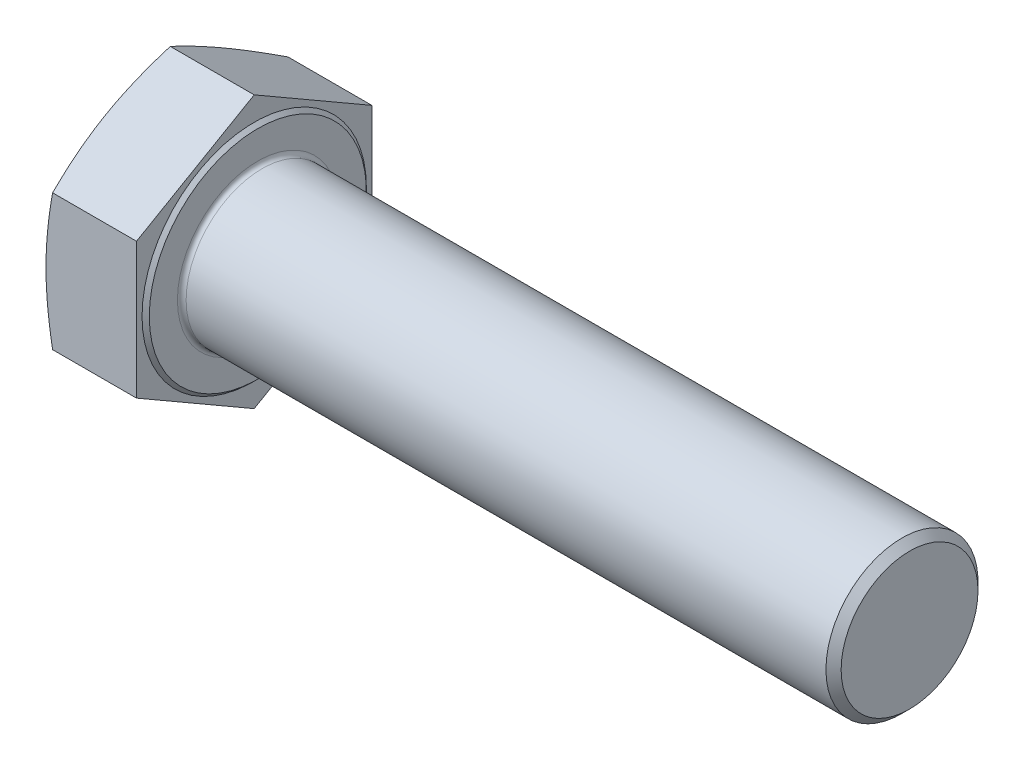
ISO-10303-21;
HEADER;
FILE_DESCRIPTION(('STEP AP214'),'2;1');
FILE_NAME('part.step','',(''),(''),'','','');
FILE_SCHEMA(('AUTOMOTIVE_DESIGN { 1 0 10303 214 1 1 1 1 }'));
ENDSEC;
DATA;
#1=APPLICATION_CONTEXT('core data for automotive mechanical design processes');
#2=APPLICATION_PROTOCOL_DEFINITION('international standard','automotive_design',2000,#1);
#3=PRODUCT_CONTEXT('',#1,'mechanical');
#4=PRODUCT('Part','Part','',(#3));
#5=PRODUCT_RELATED_PRODUCT_CATEGORY('part','',(#4));
#6=PRODUCT_DEFINITION_FORMATION('','',#4);
#7=PRODUCT_DEFINITION_CONTEXT('part definition',#1,'design');
#8=PRODUCT_DEFINITION('design','',#6,#7);
#9=PRODUCT_DEFINITION_SHAPE('','',#8);
#10=(LENGTH_UNIT() NAMED_UNIT(*) SI_UNIT(.MILLI.,.METRE.));
#11=(NAMED_UNIT(*) PLANE_ANGLE_UNIT() SI_UNIT($,.RADIAN.));
#12=(NAMED_UNIT(*) SI_UNIT($,.STERADIAN.) SOLID_ANGLE_UNIT());
#13=UNCERTAINTY_MEASURE_WITH_UNIT(LENGTH_MEASURE(1.E-05),#10,'distance_accuracy_value','');
#14=(GEOMETRIC_REPRESENTATION_CONTEXT(3) GLOBAL_UNCERTAINTY_ASSIGNED_CONTEXT((#13)) GLOBAL_UNIT_ASSIGNED_CONTEXT((#10,
#11,#12)) REPRESENTATION_CONTEXT('',''));
#15=CARTESIAN_POINT('',(0.,0.,0.));
#16=DIRECTION('',(0.,0.,1.));
#17=DIRECTION('',(1.,0.,0.));
#18=AXIS2_PLACEMENT_3D('',#15,#16,#17);
#19=CARTESIAN_POINT('',(26.,0.,65.));
#20=DIRECTION('',(-1.,0.,0.));
#21=DIRECTION('',(0.,0.,1.));
#22=AXIS2_PLACEMENT_3D('',#19,#20,#21);
#23=PLANE('',#22);
#24=CARTESIAN_POINT('',(26.,0.,0.));
#25=DIRECTION('',(-1.,0.,0.));
#26=DIRECTION('',(0.,0.,1.));
#27=AXIS2_PLACEMENT_3D('',#24,#25,#26);
#28=CIRCLE('',#27,22.2);
#29=CARTESIAN_POINT('',(26.,0.,22.2));
#30=VERTEX_POINT('',#29);
#31=EDGE_CURVE('E11',#30,#30,#28,.T.);
#32=ORIENTED_EDGE('',*,*,#31,.T.);
#33=EDGE_LOOP('',(#32));
#34=FACE_BOUND('',#33,.T.);
#35=CARTESIAN_POINT('',(26.,0.,0.));
#36=DIRECTION('',(-1.,0.,0.));
#37=DIRECTION('',(0.,0.,1.));
#38=AXIS2_PLACEMENT_3D('',#35,#36,#37);
#39=CIRCLE('',#38,29.975);
#40=CARTESIAN_POINT('',(26.,0.,29.975));
#41=VERTEX_POINT('',#40);
#42=EDGE_CURVE('E265',#41,#41,#39,.T.);
#43=ORIENTED_EDGE('',*,*,#42,.F.);
#44=EDGE_LOOP('',(#43));
#45=FACE_BOUND('',#44,.T.);
#46=ADVANCED_FACE('F32',(#34,#45),#23,.F.);
#47=CARTESIAN_POINT('',(26.,-18.7638837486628,32.5));
#48=DIRECTION('',(0.,0.866025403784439,-0.5));
#49=DIRECTION('',(0.,0.5,0.866025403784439));
#50=AXIS2_PLACEMENT_3D('',#47,#48,#49);
#51=PLANE('',#50);
#52=CARTESIAN_POINT('',(1.82999974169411,-37.5278829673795,-0.000199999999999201));
#53=CARTESIAN_POINT('',(1.68857418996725,-37.139311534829,0.672825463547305));
#54=CARTESIAN_POINT('',(1.55351316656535,-36.7501472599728,1.34687776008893));
#55=CARTESIAN_POINT('',(1.29751061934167,-35.9706235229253,2.6970524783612));
#56=CARTESIAN_POINT('',(1.17657043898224,-35.5802639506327,3.37317509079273));
#57=CARTESIAN_POINT('',(0.950141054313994,-34.7981155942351,4.72789578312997));
#58=CARTESIAN_POINT('',(0.844663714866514,-34.4063259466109,5.40649535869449));
#59=CARTESIAN_POINT('',(0.65067018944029,-33.6217048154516,6.76549902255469));
#60=CARTESIAN_POINT('',(0.562153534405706,-33.2288733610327,7.44590306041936));
#61=CARTESIAN_POINT('',(0.404133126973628,-32.4459927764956,8.80189200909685));
#62=CARTESIAN_POINT('',(0.334457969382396,-32.0559523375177,9.47746186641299));
#63=CARTESIAN_POINT('',(0.214136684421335,-31.2751323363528,10.8298817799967));
#64=CARTESIAN_POINT('',(0.163490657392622,-30.8843527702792,11.5067318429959));
#65=CARTESIAN_POINT('',(0.0821085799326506,-30.1024159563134,12.8610861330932));
#66=CARTESIAN_POINT('',(0.0513652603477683,-29.7112588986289,13.5385900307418));
#67=CARTESIAN_POINT('',(0.0103110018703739,-28.9286764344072,14.8940626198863));
#68=CARTESIAN_POINT('',(0.,-28.5372510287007,15.5720313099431));
#69=CARTESIAN_POINT('',(0.,-27.7544002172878,16.9279686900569));
#70=CARTESIAN_POINT('',(0.0103110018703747,-27.3629748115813,17.6059373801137));
#71=CARTESIAN_POINT('',(0.0513652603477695,-26.5803923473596,18.9614099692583));
#72=CARTESIAN_POINT('',(0.0821085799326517,-26.1892352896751,19.6389138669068));
#73=CARTESIAN_POINT('',(0.163490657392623,-25.4072984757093,20.9932681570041));
#74=CARTESIAN_POINT('',(0.214136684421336,-25.0165189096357,21.6701182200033));
#75=CARTESIAN_POINT('',(0.334457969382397,-24.2356989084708,23.022538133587));
#76=CARTESIAN_POINT('',(0.404133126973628,-23.8456584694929,23.6981079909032));
#77=CARTESIAN_POINT('',(0.562153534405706,-23.0627778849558,25.0540969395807));
#78=CARTESIAN_POINT('',(0.65067018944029,-22.6699464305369,25.7345009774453));
#79=CARTESIAN_POINT('',(0.844663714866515,-21.8853252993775,27.0935046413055));
#80=CARTESIAN_POINT('',(0.950141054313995,-21.4935356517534,27.77210421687));
#81=CARTESIAN_POINT('',(1.17657043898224,-20.7113872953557,29.1268249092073));
#82=CARTESIAN_POINT('',(1.29751061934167,-20.3210277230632,29.8029475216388));
#83=CARTESIAN_POINT('',(1.55351316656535,-19.5415039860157,31.1531222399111));
#84=CARTESIAN_POINT('',(1.68857418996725,-19.1523397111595,31.8271745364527));
#85=CARTESIAN_POINT('',(1.82999974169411,-18.763768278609,32.5002));
#86=B_SPLINE_CURVE_WITH_KNOTS('',3,(#52,#53,#54,#55,#56,#57,#58,#59,#60,#61,#62,#63,#64,#65,#66,
#67,#68,#69,#70,#71,#72,#73,#74,#75,#76,#77,#78,#79,#80,#81,#82,#83,#84,#85),.UNSPECIFIED.,.F.,
.F.,(4,2,2,2,2,2,2,2,2,2,2,2,2,2,2,2,4),(0.,2.36973307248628,4.73969141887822,7.11145885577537,
9.48316069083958,11.8324994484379,14.1818505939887,16.5303431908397,18.8788285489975,
21.2273139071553,23.5758065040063,25.925157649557,28.2744964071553,30.6461982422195,
33.0179656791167,35.3879240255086,37.7576570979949),.UNSPECIFIED.);
#87=CARTESIAN_POINT('',(1.8299577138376,-37.5277674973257,0.));
#88=VERTEX_POINT('',#87);
#89=CARTESIAN_POINT('',(0.,-28.1458256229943,16.25));
#90=VERTEX_POINT('',#89);
#91=EDGE_CURVE('E279',#88,#90,#86,.T.);
#92=ORIENTED_EDGE('',*,*,#91,.F.);
#93=DIRECTION('',(-1.,0.,0.));
#94=VECTOR('',#93,1.);
#95=CARTESIAN_POINT('',(26.,-37.5277674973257,0.));
#96=LINE('',#95,#94);
#97=CARTESIAN_POINT('',(25.,-37.5277674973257,0.));
#98=VERTEX_POINT('',#97);
#99=EDGE_CURVE('E144',#98,#88,#96,.T.);
#100=ORIENTED_EDGE('',*,*,#99,.F.);
#101=DIRECTION('',(0.,-0.5,-0.866025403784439));
#102=VECTOR('',#101,1.);
#103=CARTESIAN_POINT('',(25.,-18.7638837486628,32.5));
#104=LINE('',#103,#102);
#105=CARTESIAN_POINT('',(25.,-18.7638837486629,32.5));
#106=VERTEX_POINT('',#105);
#107=EDGE_CURVE('E135',#106,#98,#104,.T.);
#108=ORIENTED_EDGE('',*,*,#107,.F.);
#109=DIRECTION('',(-1.,0.,0.));
#110=VECTOR('',#109,1.);
#111=CARTESIAN_POINT('',(26.,-18.7638837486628,32.5));
#112=LINE('',#111,#110);
#113=CARTESIAN_POINT('',(1.8299577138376,-18.7638837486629,32.5));
#114=VERTEX_POINT('',#113);
#115=EDGE_CURVE('E130',#106,#114,#112,.T.);
#116=ORIENTED_EDGE('',*,*,#115,.T.);
#117=EDGE_CURVE('E124',#90,#114,#86,.T.);
#118=ORIENTED_EDGE('',*,*,#117,.F.);
#119=EDGE_LOOP('',(#92,#100,#108,#116,#118));
#120=FACE_BOUND('',#119,.T.);
#121=ADVANCED_FACE('F34',(#120),#51,.F.);
#122=CARTESIAN_POINT('',(26.,-37.5277674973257,0.));
#123=DIRECTION('',(0.,0.866025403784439,0.5));
#124=DIRECTION('',(0.,-0.5,0.866025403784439));
#125=AXIS2_PLACEMENT_3D('',#122,#123,#124);
#126=PLANE('',#125);
#127=CARTESIAN_POINT('',(1.82999974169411,-18.763768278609,-32.5002));
#128=CARTESIAN_POINT('',(1.68857418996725,-19.1523397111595,-31.8271745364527));
#129=CARTESIAN_POINT('',(1.55351316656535,-19.5415039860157,-31.1531222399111));
#130=CARTESIAN_POINT('',(1.29751061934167,-20.3210277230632,-29.8029475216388));
#131=CARTESIAN_POINT('',(1.17657043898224,-20.7113872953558,-29.1268249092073));
#132=CARTESIAN_POINT('',(0.950141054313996,-21.4935356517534,-27.77210421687));
#133=CARTESIAN_POINT('',(0.844663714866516,-21.8853252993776,-27.0935046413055));
#134=CARTESIAN_POINT('',(0.650670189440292,-22.6699464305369,-25.7345009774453));
#135=CARTESIAN_POINT('',(0.562153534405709,-23.0627778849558,-25.0540969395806));
#136=CARTESIAN_POINT('',(0.404133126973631,-23.8456584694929,-23.6981079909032));
#137=CARTESIAN_POINT('',(0.334457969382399,-24.2356989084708,-23.022538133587));
#138=CARTESIAN_POINT('',(0.214136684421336,-25.0165189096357,-21.6701182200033));
#139=CARTESIAN_POINT('',(0.163490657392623,-25.4072984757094,-20.9932681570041));
#140=CARTESIAN_POINT('',(0.0821085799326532,-26.1892352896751,-19.6389138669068));
#141=CARTESIAN_POINT('',(0.0513652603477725,-26.5803923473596,-18.9614099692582));
#142=CARTESIAN_POINT('',(0.0103110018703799,-27.3629748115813,-17.6059373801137));
#143=CARTESIAN_POINT('',(0.,-27.7544002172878,-16.9279686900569));
#144=CARTESIAN_POINT('',(0.,-28.5372510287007,-15.5720313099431));
#145=CARTESIAN_POINT('',(0.0103110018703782,-28.9286764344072,-14.8940626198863));
#146=CARTESIAN_POINT('',(0.0513652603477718,-29.7112588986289,-13.5385900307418));
#147=CARTESIAN_POINT('',(0.0821085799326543,-30.1024159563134,-12.8610861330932));
#148=CARTESIAN_POINT('',(0.163490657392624,-30.8843527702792,-11.5067318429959));
#149=CARTESIAN_POINT('',(0.214136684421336,-31.2751323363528,-10.8298817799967));
#150=CARTESIAN_POINT('',(0.334457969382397,-32.0559523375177,-9.47746186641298));
#151=CARTESIAN_POINT('',(0.404133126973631,-32.4459927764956,-8.80189200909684));
#152=CARTESIAN_POINT('',(0.56215353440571,-33.2288733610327,-7.44590306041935));
#153=CARTESIAN_POINT('',(0.650670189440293,-33.6217048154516,-6.76549902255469));
#154=CARTESIAN_POINT('',(0.844663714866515,-34.4063259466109,-5.40649535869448));
#155=CARTESIAN_POINT('',(0.950141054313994,-34.7981155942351,-4.72789578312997));
#156=CARTESIAN_POINT('',(1.17657043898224,-35.5802639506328,-3.37317509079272));
#157=CARTESIAN_POINT('',(1.29751061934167,-35.9706235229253,-2.69705247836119));
#158=CARTESIAN_POINT('',(1.55351316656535,-36.7501472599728,-1.34687776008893));
#159=CARTESIAN_POINT('',(1.68857418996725,-37.139311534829,-0.672825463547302));
#160=CARTESIAN_POINT('',(1.82999974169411,-37.5278829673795,0.000200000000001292));
#161=B_SPLINE_CURVE_WITH_KNOTS('',3,(#127,#128,#129,#130,#131,#132,#133,#134,#135,#136,#137,
#138,#139,#140,#141,#142,#143,#144,#145,#146,#147,#148,#149,#150,#151,#152,#153,#154,#155,#156,
#157,#158,#159,#160),.UNSPECIFIED.,.F.,.F.,(4,2,2,2,2,2,2,2,2,2,2,2,2,2,2,2,4),(0.,
2.36973307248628,4.73969141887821,7.11145885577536,9.48316069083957,11.8324994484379,
14.1818505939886,16.5303431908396,18.8788285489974,21.2273139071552,23.5758065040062,
25.925157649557,28.2744964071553,30.6461982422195,33.0179656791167,35.3879240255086,
37.7576570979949),.UNSPECIFIED.);
#162=CARTESIAN_POINT('',(1.8299577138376,-18.7638837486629,-32.5));
#163=VERTEX_POINT('',#162);
#164=CARTESIAN_POINT('',(0.,-28.1458256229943,-16.25));
#165=VERTEX_POINT('',#164);
#166=EDGE_CURVE('E231',#163,#165,#161,.T.);
#167=ORIENTED_EDGE('',*,*,#166,.F.);
#168=DIRECTION('',(-1.,0.,0.));
#169=VECTOR('',#168,1.);
#170=CARTESIAN_POINT('',(26.,-18.7638837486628,-32.5));
#171=LINE('',#170,#169);
#172=CARTESIAN_POINT('',(25.,-18.7638837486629,-32.5));
#173=VERTEX_POINT('',#172);
#174=EDGE_CURVE('E141',#173,#163,#171,.T.);
#175=ORIENTED_EDGE('',*,*,#174,.F.);
#176=DIRECTION('',(0.,0.5,-0.866025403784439));
#177=VECTOR('',#176,1.);
#178=CARTESIAN_POINT('',(25.,-37.5277674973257,0.));
#179=LINE('',#178,#177);
#180=EDGE_CURVE('E269',#98,#173,#179,.T.);
#181=ORIENTED_EDGE('',*,*,#180,.F.);
#182=ORIENTED_EDGE('',*,*,#99,.T.);
#183=EDGE_CURVE('E227',#165,#88,#161,.T.);
#184=ORIENTED_EDGE('',*,*,#183,.F.);
#185=EDGE_LOOP('',(#167,#175,#181,#182,#184));
#186=FACE_BOUND('',#185,.T.);
#187=ADVANCED_FACE('F180',(#186),#126,.F.);
#188=CARTESIAN_POINT('',(26.,-18.7638837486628,-32.5));
#189=DIRECTION('',(0.,0.,1.));
#190=DIRECTION('',(1.,0.,0.));
#191=AXIS2_PLACEMENT_3D('',#188,#189,#190);
#192=PLANE('',#191);
#193=CARTESIAN_POINT('',(9.77856830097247,-49.6801663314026,-32.5));
#194=CARTESIAN_POINT('',(9.55464495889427,-48.9449686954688,-32.5));
#195=CARTESIAN_POINT('',(9.33207255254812,-48.2093583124,-32.5));
#196=CARTESIAN_POINT('',(8.8899392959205,-46.7372286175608,-32.5));
#197=CARTESIAN_POINT('',(8.67037846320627,-46.0007093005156,-32.5));
#198=CARTESIAN_POINT('',(8.23456371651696,-44.5266295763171,-32.5));
#199=CARTESIAN_POINT('',(8.0183100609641,-43.7890690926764,-32.5));
#200=CARTESIAN_POINT('',(7.58949412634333,-42.3128777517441,-32.5));
#201=CARTESIAN_POINT('',(7.37693184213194,-41.5742468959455,-32.5));
#202=CARTESIAN_POINT('',(6.74458886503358,-39.3538448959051,-32.5));
#203=CARTESIAN_POINT('',(6.33096705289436,-37.8703103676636,-32.5));
#204=CARTESIAN_POINT('',(5.52407045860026,-34.8977282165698,-32.5));
#205=CARTESIAN_POINT('',(5.13079531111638,-33.4086806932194,-32.5));
#206=CARTESIAN_POINT('',(4.37434025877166,-30.4424733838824,-32.5));
#207=CARTESIAN_POINT('',(4.01084907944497,-28.9653933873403,-32.5));
#208=CARTESIAN_POINT('',(3.31481275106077,-26.0038846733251,-32.5));
#209=CARTESIAN_POINT('',(2.98226812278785,-24.5194558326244,-32.5));
#210=CARTESIAN_POINT('',(2.3558796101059,-21.5429118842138,-32.5));
#211=CARTESIAN_POINT('',(2.06202252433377,-20.0507995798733,-32.5));
#212=CARTESIAN_POINT('',(1.52195385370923,-17.0579267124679,-32.5));
#213=CARTESIAN_POINT('',(1.27574067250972,-15.5571664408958,-32.5));
#214=CARTESIAN_POINT('',(0.865351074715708,-12.7159237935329,-32.5));
#215=CARTESIAN_POINT('',(0.695071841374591,-11.3763367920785,-32.5));
#216=CARTESIAN_POINT('',(0.478866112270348,-9.36278026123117,-32.5));
#217=CARTESIAN_POINT('',(0.413332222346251,-8.69088651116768,-32.5));
#218=CARTESIAN_POINT('',(0.296072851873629,-7.34590138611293,-32.5));
#219=CARTESIAN_POINT('',(0.244347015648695,-6.6728100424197,-32.5));
#220=CARTESIAN_POINT('',(0.15537224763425,-5.32613328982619,-32.5));
#221=CARTESIAN_POINT('',(0.118113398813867,-4.65254853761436,-32.5));
#222=CARTESIAN_POINT('',(0.0585034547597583,-3.30471698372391,-32.5));
#223=CARTESIAN_POINT('',(0.0361523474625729,-2.63047018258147,-32.5));
#224=CARTESIAN_POINT('',(0.00665842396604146,-1.28164516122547,-32.5));
#225=CARTESIAN_POINT('',(-0.000484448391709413,-0.607066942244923,-32.5));
#226=CARTESIAN_POINT('',(0.000535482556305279,0.742078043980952,-32.5));
#227=CARTESIAN_POINT('',(0.00869829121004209,1.41664481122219,-32.5));
#228=CARTESIAN_POINT('',(0.0402981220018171,2.76884003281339,-32.5));
#229=CARTESIAN_POINT('',(0.0638123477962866,3.44646667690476,-32.5));
#230=CARTESIAN_POINT('',(0.125870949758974,4.80102827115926,-32.5));
#231=CARTESIAN_POINT('',(0.164415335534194,5.47796322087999,-32.5));
#232=CARTESIAN_POINT('',(0.256033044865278,6.83084823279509,-32.5));
#233=CARTESIAN_POINT('',(0.309106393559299,7.50679829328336,-32.5));
#234=CARTESIAN_POINT('',(0.42912450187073,8.85747203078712,-32.5));
#235=CARTESIAN_POINT('',(0.496069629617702,9.53219567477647,-32.5));
#236=CARTESIAN_POINT('',(0.716699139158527,11.5553242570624,-32.5));
#237=CARTESIAN_POINT('',(0.890102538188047,12.901611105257,-32.5));
#238=CARTESIAN_POINT('',(1.28249994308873,15.5874039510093,-32.5));
#239=CARTESIAN_POINT('',(1.50149419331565,16.9269099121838,-32.5));
#240=CARTESIAN_POINT('',(1.9905390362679,19.6696859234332,-32.5));
#241=CARTESIAN_POINT('',(2.26267752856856,21.0725810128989,-32.5));
#242=CARTESIAN_POINT('',(2.8419809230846,23.8711634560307,-32.5));
#243=CARTESIAN_POINT('',(3.14914846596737,25.2668502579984,-32.5));
#244=CARTESIAN_POINT('',(3.79205940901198,28.0520151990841,-32.5));
#245=CARTESIAN_POINT('',(4.12781110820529,29.441491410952,-32.5));
#246=CARTESIAN_POINT('',(4.82242885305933,32.2145903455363,-32.5));
#247=CARTESIAN_POINT('',(5.181294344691,33.5982132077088,-32.5));
#248=CARTESIAN_POINT('',(5.91829208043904,36.3622032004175,-32.5));
#249=CARTESIAN_POINT('',(6.29644847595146,37.7425638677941,-32.5));
#250=CARTESIAN_POINT('',(7.06814427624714,40.4989726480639,-32.5));
#251=CARTESIAN_POINT('',(7.46168374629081,41.8750207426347,-32.5));
#252=CARTESIAN_POINT('',(8.26133009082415,44.6232021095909,-32.5));
#253=CARTESIAN_POINT('',(8.6674348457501,45.9953360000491,-32.5));
#254=CARTESIAN_POINT('',(9.49009142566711,48.7364599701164,-32.5));
#255=CARTESIAN_POINT('',(9.90664322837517,50.1054500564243,-32.5));
#256=CARTESIAN_POINT('',(10.7438067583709,52.8256473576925,-32.5));
#257=CARTESIAN_POINT('',(11.1643228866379,54.176884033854,-32.5));
#258=CARTESIAN_POINT('',(12.0125182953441,56.8771051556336,-32.5));
#259=CARTESIAN_POINT('',(12.4401975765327,58.226089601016,-32.5));
#260=CARTESIAN_POINT('',(13.3016435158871,60.9221799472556,-32.5));
#261=CARTESIAN_POINT('',(13.7354104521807,62.2692857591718,-32.5));
#262=CARTESIAN_POINT('',(14.6081202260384,64.9618200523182,-32.5));
#263=CARTESIAN_POINT('',(15.0470630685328,66.3072485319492,-32.5));
#264=CARTESIAN_POINT('',(15.9277167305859,68.9915427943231,-32.5));
#265=CARTESIAN_POINT('',(16.3694107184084,70.3304141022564,-32.5));
#266=CARTESIAN_POINT('',(17.2566101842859,73.0068935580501,-32.5));
#267=CARTESIAN_POINT('',(17.7021156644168,74.3445017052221,-32.5));
#268=CARTESIAN_POINT('',(18.5963991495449,77.0185013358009,-32.5));
#269=CARTESIAN_POINT('',(19.0451768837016,78.3548929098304,-32.5));
#270=CARTESIAN_POINT('',(19.9456362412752,81.0266939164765,-32.5));
#271=CARTESIAN_POINT('',(20.3973178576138,82.3621033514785,-32.5));
#272=CARTESIAN_POINT('',(20.8502501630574,83.6970874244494,-32.5));
#273=B_SPLINE_CURVE_WITH_KNOTS('',3,(#193,#194,#195,#196,#197,#198,#199,#200,#201,#202,#203,
#204,#205,#206,#207,#208,#209,#210,#211,#212,#213,#214,#215,#216,#217,#218,#219,#220,#221,#222,
#223,#224,#225,#226,#227,#228,#229,#230,#231,#232,#233,#234,#235,#236,#237,#238,#239,#240,#241,
#242,#243,#244,#245,#246,#247,#248,#249,#250,#251,#252,#253,#254,#255,#256,#257,#258,#259,#260,
#261,#262,#263,#264,#265,#266,#267,#268,#269,#270,#271,#272),.UNSPECIFIED.,.F.,.F.,(4,2,2,2,2,2,
2,2,2,2,2,2,2,2,2,2,2,2,2,2,2,2,2,2,2,2,2,2,2,2,2,2,2,2,2,2,2,2,2,4),(0.,2.30562725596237,
4.61126795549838,6.91708790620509,9.22290464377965,13.8431310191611,18.4632744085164,
23.0264538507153,27.5897100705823,32.1514051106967,36.7129472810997,40.7630536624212,
42.7881803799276,44.8132549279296,46.8369388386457,48.8606211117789,50.8842959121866,
52.9079714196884,54.9419033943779,56.9758366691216,59.0097734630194,61.0437642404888,
65.1149785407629,69.1862146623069,73.4727979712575,77.7597046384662,82.0478602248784,
86.3359130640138,90.6294728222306,94.9230507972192,99.215908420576,103.508756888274,
107.754209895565,111.999663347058,116.245311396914,120.490963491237,124.720499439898,
128.95003769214,133.179229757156,137.408411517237),.UNSPECIFIED.);
#274=CARTESIAN_POINT('',(1.8299577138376,18.7638837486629,-32.5));
#275=VERTEX_POINT('',#274);
#276=CARTESIAN_POINT('',(0.,0.,-32.5));
#277=VERTEX_POINT('',#276);
#278=EDGE_CURVE('E304',#275,#277,#273,.F.);
#279=ORIENTED_EDGE('',*,*,#278,.F.);
#280=DIRECTION('',(-1.,0.,0.));
#281=VECTOR('',#280,1.);
#282=CARTESIAN_POINT('',(26.,18.7638837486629,-32.5));
#283=LINE('',#282,#281);
#284=CARTESIAN_POINT('',(25.,18.7638837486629,-32.5));
#285=VERTEX_POINT('',#284);
#286=EDGE_CURVE('E132',#285,#275,#283,.T.);
#287=ORIENTED_EDGE('',*,*,#286,.F.);
#288=DIRECTION('',(0.,1.,0.));
#289=VECTOR('',#288,1.);
#290=CARTESIAN_POINT('',(25.,-18.7638837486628,-32.5));
#291=LINE('',#290,#289);
#292=EDGE_CURVE('E262',#173,#285,#291,.T.);
#293=ORIENTED_EDGE('',*,*,#292,.F.);
#294=ORIENTED_EDGE('',*,*,#174,.T.);
#295=EDGE_CURVE('E232',#277,#163,#273,.F.);
#296=ORIENTED_EDGE('',*,*,#295,.F.);
#297=EDGE_LOOP('',(#279,#287,#293,#294,#296));
#298=FACE_BOUND('',#297,.T.);
#299=ADVANCED_FACE('F240',(#298),#192,.F.);
#300=CARTESIAN_POINT('',(26.,18.7638837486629,-32.5));
#301=DIRECTION('',(0.,-0.866025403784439,0.5));
#302=DIRECTION('',(0.,-0.5,-0.866025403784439));
#303=AXIS2_PLACEMENT_3D('',#300,#301,#302);
#304=PLANE('',#303);
#305=CARTESIAN_POINT('',(1.82999974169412,37.5278829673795,0.000199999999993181));
#306=CARTESIAN_POINT('',(1.68857418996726,37.139311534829,-0.67282546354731));
#307=CARTESIAN_POINT('',(1.55351316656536,36.7501472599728,-1.34687776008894));
#308=CARTESIAN_POINT('',(1.29751061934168,35.9706235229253,-2.69705247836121));
#309=CARTESIAN_POINT('',(1.17657043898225,35.5802639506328,-3.37317509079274));
#310=CARTESIAN_POINT('',(0.950141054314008,34.7981155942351,-4.72789578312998));
#311=CARTESIAN_POINT('',(0.844663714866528,34.406325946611,-5.40649535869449));
#312=CARTESIAN_POINT('',(0.650670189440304,33.6217048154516,-6.7654990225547));
#313=CARTESIAN_POINT('',(0.562153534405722,33.2288733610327,-7.44590306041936));
#314=CARTESIAN_POINT('',(0.404133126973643,32.4459927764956,-8.80189200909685));
#315=CARTESIAN_POINT('',(0.334457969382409,32.0559523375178,-9.47746186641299));
#316=CARTESIAN_POINT('',(0.214136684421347,31.2751323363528,-10.8298817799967));
#317=CARTESIAN_POINT('',(0.163490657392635,30.8843527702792,-11.5067318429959));
#318=CARTESIAN_POINT('',(0.0821085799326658,30.1024159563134,-12.8610861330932));
#319=CARTESIAN_POINT('',(0.0513652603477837,29.711258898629,-13.5385900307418));
#320=CARTESIAN_POINT('',(0.0103110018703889,28.9286764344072,-14.8940626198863));
#321=CARTESIAN_POINT('',(0.,28.5372510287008,-15.5720313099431));
#322=CARTESIAN_POINT('',(0.,27.7544002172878,-16.9279686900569));
#323=CARTESIAN_POINT('',(0.0103110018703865,27.3629748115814,-17.6059373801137));
#324=CARTESIAN_POINT('',(0.0513652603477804,26.5803923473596,-18.9614099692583));
#325=CARTESIAN_POINT('',(0.082108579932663,26.1892352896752,-19.6389138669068));
#326=CARTESIAN_POINT('',(0.163490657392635,25.4072984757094,-20.9932681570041));
#327=CARTESIAN_POINT('',(0.214136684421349,25.0165189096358,-21.6701182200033));
#328=CARTESIAN_POINT('',(0.334457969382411,24.2356989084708,-23.022538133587));
#329=CARTESIAN_POINT('',(0.404133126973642,23.8456584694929,-23.6981079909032));
#330=CARTESIAN_POINT('',(0.562153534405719,23.0627778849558,-25.0540969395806));
#331=CARTESIAN_POINT('',(0.650670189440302,22.669946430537,-25.7345009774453));
#332=CARTESIAN_POINT('',(0.844663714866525,21.8853252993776,-27.0935046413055));
#333=CARTESIAN_POINT('',(0.950141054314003,21.4935356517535,-27.77210421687));
#334=CARTESIAN_POINT('',(1.17657043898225,20.7113872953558,-29.1268249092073));
#335=CARTESIAN_POINT('',(1.29751061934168,20.3210277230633,-29.8029475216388));
#336=CARTESIAN_POINT('',(1.55351316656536,19.5415039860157,-31.1531222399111));
#337=CARTESIAN_POINT('',(1.68857418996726,19.1523397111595,-31.8271745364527));
#338=CARTESIAN_POINT('',(1.82999974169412,18.763768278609,-32.5002));
#339=B_SPLINE_CURVE_WITH_KNOTS('',3,(#305,#306,#307,#308,#309,#310,#311,#312,#313,#314,#315,
#316,#317,#318,#319,#320,#321,#322,#323,#324,#325,#326,#327,#328,#329,#330,#331,#332,#333,#334,
#335,#336,#337,#338),.UNSPECIFIED.,.F.,.F.,(4,2,2,2,2,2,2,2,2,2,2,2,2,2,2,2,4),(0.,
2.36973307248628,4.73969141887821,7.11145885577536,9.48316069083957,11.8324994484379,
14.1818505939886,16.5303431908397,18.8788285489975,21.2273139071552,23.5758065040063,
25.925157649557,28.2744964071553,30.6461982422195,33.0179656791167,35.3879240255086,
37.7576570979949),.UNSPECIFIED.);
#340=CARTESIAN_POINT('',(1.8299577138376,37.5277674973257,0.));
#341=VERTEX_POINT('',#340);
#342=CARTESIAN_POINT('',(0.,28.1458256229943,-16.25));
#343=VERTEX_POINT('',#342);
#344=EDGE_CURVE('E222',#341,#343,#339,.T.);
#345=ORIENTED_EDGE('',*,*,#344,.F.);
#346=DIRECTION('',(-1.,0.,0.));
#347=VECTOR('',#346,1.);
#348=CARTESIAN_POINT('',(26.,37.5277674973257,0.));
#349=LINE('',#348,#347);
#350=CARTESIAN_POINT('',(25.,37.5277674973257,0.));
#351=VERTEX_POINT('',#350);
#352=EDGE_CURVE('E129',#351,#341,#349,.T.);
#353=ORIENTED_EDGE('',*,*,#352,.F.);
#354=DIRECTION('',(0.,0.5,0.866025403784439));
#355=VECTOR('',#354,1.);
#356=CARTESIAN_POINT('',(25.,18.7638837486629,-32.5));
#357=LINE('',#356,#355);
#358=EDGE_CURVE('E259',#285,#351,#357,.T.);
#359=ORIENTED_EDGE('',*,*,#358,.F.);
#360=ORIENTED_EDGE('',*,*,#286,.T.);
#361=EDGE_CURVE('E256',#343,#275,#339,.T.);
#362=ORIENTED_EDGE('',*,*,#361,.F.);
#363=EDGE_LOOP('',(#345,#353,#359,#360,#362));
#364=FACE_BOUND('',#363,.T.);
#365=ADVANCED_FACE('F244',(#364),#304,.F.);
#366=CARTESIAN_POINT('',(26.,37.5277674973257,0.));
#367=DIRECTION('',(0.,-0.866025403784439,-0.5));
#368=DIRECTION('',(0.,0.5,-0.866025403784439));
#369=AXIS2_PLACEMENT_3D('',#366,#367,#368);
#370=PLANE('',#369);
#371=CARTESIAN_POINT('',(1.82999974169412,18.763768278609,32.5002));
#372=CARTESIAN_POINT('',(1.68857418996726,19.1523397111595,31.8271745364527));
#373=CARTESIAN_POINT('',(1.55351316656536,19.5415039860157,31.1531222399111));
#374=CARTESIAN_POINT('',(1.29751061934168,20.3210277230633,29.8029475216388));
#375=CARTESIAN_POINT('',(1.17657043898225,20.7113872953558,29.1268249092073));
#376=CARTESIAN_POINT('',(0.950141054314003,21.4935356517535,27.77210421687));
#377=CARTESIAN_POINT('',(0.844663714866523,21.8853252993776,27.0935046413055));
#378=CARTESIAN_POINT('',(0.650670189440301,22.669946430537,25.7345009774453));
#379=CARTESIAN_POINT('',(0.562153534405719,23.0627778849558,25.0540969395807));
#380=CARTESIAN_POINT('',(0.404133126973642,23.845658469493,23.6981079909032));
#381=CARTESIAN_POINT('',(0.334457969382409,24.2356989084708,23.022538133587));
#382=CARTESIAN_POINT('',(0.214136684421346,25.0165189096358,21.6701182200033));
#383=CARTESIAN_POINT('',(0.163490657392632,25.4072984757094,20.9932681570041));
#384=CARTESIAN_POINT('',(0.0821085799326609,26.1892352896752,19.6389138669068));
#385=CARTESIAN_POINT('',(0.0513652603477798,26.5803923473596,18.9614099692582));
#386=CARTESIAN_POINT('',(0.0103110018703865,27.3629748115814,17.6059373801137));
#387=CARTESIAN_POINT('',(0.,27.7544002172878,16.9279686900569));
#388=CARTESIAN_POINT('',(0.,28.5372510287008,15.5720313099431));
#389=CARTESIAN_POINT('',(0.0103110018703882,28.9286764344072,14.8940626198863));
#390=CARTESIAN_POINT('',(0.0513652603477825,29.711258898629,13.5385900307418));
#391=CARTESIAN_POINT('',(0.082108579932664,30.1024159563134,12.8610861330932));
#392=CARTESIAN_POINT('',(0.163490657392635,30.8843527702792,11.5067318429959));
#393=CARTESIAN_POINT('',(0.214136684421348,31.2751323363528,10.8298817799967));
#394=CARTESIAN_POINT('',(0.33445796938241,32.0559523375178,9.47746186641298));
#395=CARTESIAN_POINT('',(0.404133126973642,32.4459927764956,8.80189200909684));
#396=CARTESIAN_POINT('',(0.56215353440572,33.2288733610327,7.44590306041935));
#397=CARTESIAN_POINT('',(0.650670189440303,33.6217048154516,6.76549902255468));
#398=CARTESIAN_POINT('',(0.844663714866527,34.406325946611,5.40649535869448));
#399=CARTESIAN_POINT('',(0.950141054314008,34.7981155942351,4.72789578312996));
#400=CARTESIAN_POINT('',(1.17657043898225,35.5802639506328,3.37317509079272));
#401=CARTESIAN_POINT('',(1.29751061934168,35.9706235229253,2.69705247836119));
#402=CARTESIAN_POINT('',(1.55351316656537,36.7501472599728,1.34687776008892));
#403=CARTESIAN_POINT('',(1.68857418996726,37.139311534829,0.672825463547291));
#404=CARTESIAN_POINT('',(1.82999974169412,37.5278829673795,-0.000200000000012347));
#405=B_SPLINE_CURVE_WITH_KNOTS('',3,(#371,#372,#373,#374,#375,#376,#377,#378,#379,#380,#381,
#382,#383,#384,#385,#386,#387,#388,#389,#390,#391,#392,#393,#394,#395,#396,#397,#398,#399,#400,
#401,#402,#403,#404),.UNSPECIFIED.,.F.,.F.,(4,2,2,2,2,2,2,2,2,2,2,2,2,2,2,2,4),(0.,
2.36973307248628,4.73969141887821,7.11145885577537,9.48316069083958,11.8324994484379,
14.1818505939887,16.5303431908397,18.8788285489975,21.2273139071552,23.5758065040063,
25.925157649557,28.2744964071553,30.6461982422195,33.0179656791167,35.3879240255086,
37.7576570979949),.UNSPECIFIED.);
#406=CARTESIAN_POINT('',(1.8299577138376,18.7638837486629,32.5));
#407=VERTEX_POINT('',#406);
#408=CARTESIAN_POINT('',(0.,28.1458256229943,16.25));
#409=VERTEX_POINT('',#408);
#410=EDGE_CURVE('E109',#407,#409,#405,.T.);
#411=ORIENTED_EDGE('',*,*,#410,.F.);
#412=DIRECTION('',(-1.,0.,0.));
#413=VECTOR('',#412,1.);
#414=CARTESIAN_POINT('',(26.,18.7638837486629,32.5));
#415=LINE('',#414,#413);
#416=CARTESIAN_POINT('',(25.,18.7638837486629,32.5));
#417=VERTEX_POINT('',#416);
#418=EDGE_CURVE('E121',#417,#407,#415,.T.);
#419=ORIENTED_EDGE('',*,*,#418,.F.);
#420=DIRECTION('',(0.,-0.5,0.866025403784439));
#421=VECTOR('',#420,1.);
#422=CARTESIAN_POINT('',(25.,37.5277674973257,0.));
#423=LINE('',#422,#421);
#424=EDGE_CURVE('E56',#351,#417,#423,.T.);
#425=ORIENTED_EDGE('',*,*,#424,.F.);
#426=ORIENTED_EDGE('',*,*,#352,.T.);
#427=EDGE_CURVE('E123',#409,#341,#405,.T.);
#428=ORIENTED_EDGE('',*,*,#427,.F.);
#429=EDGE_LOOP('',(#411,#419,#425,#426,#428));
#430=FACE_BOUND('',#429,.T.);
#431=ADVANCED_FACE('F120',(#430),#370,.F.);
#432=CARTESIAN_POINT('',(26.,18.7638837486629,32.5));
#433=DIRECTION('',(0.,0.,-1.));
#434=DIRECTION('',(-1.,0.,0.));
#435=AXIS2_PLACEMENT_3D('',#432,#433,#434);
#436=PLANE('',#435);
#437=CARTESIAN_POINT('',(9.77856830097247,-49.6801663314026,32.5));
#438=CARTESIAN_POINT('',(9.55464495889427,-48.9449686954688,32.5));
#439=CARTESIAN_POINT('',(9.33207255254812,-48.2093583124,32.5));
#440=CARTESIAN_POINT('',(8.8899392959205,-46.7372286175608,32.5));
#441=CARTESIAN_POINT('',(8.67037846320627,-46.0007093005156,32.5));
#442=CARTESIAN_POINT('',(8.23456371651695,-44.5266295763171,32.5));
#443=CARTESIAN_POINT('',(8.0183100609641,-43.7890690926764,32.5));
#444=CARTESIAN_POINT('',(7.58949412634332,-42.3128777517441,32.5));
#445=CARTESIAN_POINT('',(7.37693184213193,-41.5742468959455,32.5));
#446=CARTESIAN_POINT('',(6.74458886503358,-39.3538448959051,32.5));
#447=CARTESIAN_POINT('',(6.33096705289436,-37.8703103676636,32.5));
#448=CARTESIAN_POINT('',(5.52407045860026,-34.8977282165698,32.5));
#449=CARTESIAN_POINT('',(5.13079531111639,-33.4086806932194,32.5));
#450=CARTESIAN_POINT('',(4.37434025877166,-30.4424733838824,32.5));
#451=CARTESIAN_POINT('',(4.01084907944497,-28.9653933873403,32.5));
#452=CARTESIAN_POINT('',(3.31481275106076,-26.0038846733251,32.5));
#453=CARTESIAN_POINT('',(2.98226812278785,-24.5194558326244,32.5));
#454=CARTESIAN_POINT('',(2.35587961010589,-21.5429118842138,32.5));
#455=CARTESIAN_POINT('',(2.06202252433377,-20.0507995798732,32.5));
#456=CARTESIAN_POINT('',(1.52195385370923,-17.0579267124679,32.5));
#457=CARTESIAN_POINT('',(1.27574067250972,-15.5571664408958,32.5));
#458=CARTESIAN_POINT('',(0.865351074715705,-12.7159237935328,32.5));
#459=CARTESIAN_POINT('',(0.695071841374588,-11.3763367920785,32.5));
#460=CARTESIAN_POINT('',(0.478866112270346,-9.36278026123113,32.5));
#461=CARTESIAN_POINT('',(0.41333222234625,-8.69088651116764,32.5));
#462=CARTESIAN_POINT('',(0.296072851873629,-7.34590138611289,32.5));
#463=CARTESIAN_POINT('',(0.244347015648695,-6.67281004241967,32.5));
#464=CARTESIAN_POINT('',(0.15537224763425,-5.32613328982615,32.5));
#465=CARTESIAN_POINT('',(0.118113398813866,-4.65254853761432,32.5));
#466=CARTESIAN_POINT('',(0.0585034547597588,-3.30471698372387,32.5));
#467=CARTESIAN_POINT('',(0.0361523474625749,-2.63047018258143,32.5));
#468=CARTESIAN_POINT('',(0.00665842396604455,-1.28164516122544,32.5));
#469=CARTESIAN_POINT('',(-0.000484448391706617,-0.607066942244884,32.5));
#470=CARTESIAN_POINT('',(0.000535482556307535,0.74207804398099,32.5));
#471=CARTESIAN_POINT('',(0.00869829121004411,1.41664481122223,32.5));
#472=CARTESIAN_POINT('',(0.0402981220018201,2.76884003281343,32.5));
#473=CARTESIAN_POINT('',(0.063812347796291,3.4464666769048,32.5));
#474=CARTESIAN_POINT('',(0.125870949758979,4.8010282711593,32.5));
#475=CARTESIAN_POINT('',(0.1644153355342,5.47796322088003,32.5));
#476=CARTESIAN_POINT('',(0.256033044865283,6.83084823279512,32.5));
#477=CARTESIAN_POINT('',(0.309106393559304,7.50679829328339,32.5));
#478=CARTESIAN_POINT('',(0.429124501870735,8.85747203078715,32.5));
#479=CARTESIAN_POINT('',(0.496069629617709,9.53219567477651,32.5));
#480=CARTESIAN_POINT('',(0.716699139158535,11.5553242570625,32.5));
#481=CARTESIAN_POINT('',(0.890102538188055,12.901611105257,32.5));
#482=CARTESIAN_POINT('',(1.28249994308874,15.5874039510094,32.5));
#483=CARTESIAN_POINT('',(1.50149419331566,16.9269099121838,32.5));
#484=CARTESIAN_POINT('',(1.99053903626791,19.6696859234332,32.5));
#485=CARTESIAN_POINT('',(2.26267752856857,21.072581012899,32.5));
#486=CARTESIAN_POINT('',(2.84198092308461,23.8711634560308,32.5));
#487=CARTESIAN_POINT('',(3.14914846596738,25.2668502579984,32.5));
#488=CARTESIAN_POINT('',(3.79205940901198,28.0520151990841,32.5));
#489=CARTESIAN_POINT('',(4.1278111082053,29.4414914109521,32.5));
#490=CARTESIAN_POINT('',(4.82242885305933,32.2145903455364,32.5));
#491=CARTESIAN_POINT('',(5.181294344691,33.5982132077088,32.5));
#492=CARTESIAN_POINT('',(5.91829208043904,36.3622032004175,32.5));
#493=CARTESIAN_POINT('',(6.29644847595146,37.7425638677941,32.5));
#494=CARTESIAN_POINT('',(7.06814427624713,40.4989726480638,32.5));
#495=CARTESIAN_POINT('',(7.46168374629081,41.8750207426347,32.5));
#496=CARTESIAN_POINT('',(8.26133009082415,44.6232021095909,32.5));
#497=CARTESIAN_POINT('',(8.6674348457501,45.9953360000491,32.5));
#498=CARTESIAN_POINT('',(9.4900914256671,48.7364599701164,32.5));
#499=CARTESIAN_POINT('',(9.90664322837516,50.1054500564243,32.5));
#500=CARTESIAN_POINT('',(10.7438067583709,52.8256473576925,32.5));
#501=CARTESIAN_POINT('',(11.1643228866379,54.176884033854,32.5));
#502=CARTESIAN_POINT('',(12.0125182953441,56.8771051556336,32.5));
#503=CARTESIAN_POINT('',(12.4401975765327,58.226089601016,32.5));
#504=CARTESIAN_POINT('',(13.301643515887,60.9221799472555,32.5));
#505=CARTESIAN_POINT('',(13.7354104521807,62.2692857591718,32.5));
#506=CARTESIAN_POINT('',(14.6081202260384,64.9618200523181,32.5));
#507=CARTESIAN_POINT('',(15.0470630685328,66.3072485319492,32.5));
#508=CARTESIAN_POINT('',(15.9277167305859,68.991542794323,32.5));
#509=CARTESIAN_POINT('',(16.3694107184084,70.3304141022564,32.5));
#510=CARTESIAN_POINT('',(17.2566101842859,73.00689355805,32.5));
#511=CARTESIAN_POINT('',(17.7021156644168,74.3445017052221,32.5));
#512=CARTESIAN_POINT('',(18.5963991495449,77.0185013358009,32.5));
#513=CARTESIAN_POINT('',(19.0451768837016,78.3548929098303,32.5));
#514=CARTESIAN_POINT('',(19.9456362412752,81.0266939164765,32.5));
#515=CARTESIAN_POINT('',(20.3973178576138,82.3621033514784,32.5));
#516=CARTESIAN_POINT('',(20.8502501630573,83.6970874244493,32.5));
#517=B_SPLINE_CURVE_WITH_KNOTS('',3,(#437,#438,#439,#440,#441,#442,#443,#444,#445,#446,#447,
#448,#449,#450,#451,#452,#453,#454,#455,#456,#457,#458,#459,#460,#461,#462,#463,#464,#465,#466,
#467,#468,#469,#470,#471,#472,#473,#474,#475,#476,#477,#478,#479,#480,#481,#482,#483,#484,#485,
#486,#487,#488,#489,#490,#491,#492,#493,#494,#495,#496,#497,#498,#499,#500,#501,#502,#503,#504,
#505,#506,#507,#508,#509,#510,#511,#512,#513,#514,#515,#516),.UNSPECIFIED.,.F.,.F.,(4,2,2,2,2,2,
2,2,2,2,2,2,2,2,2,2,2,2,2,2,2,2,2,2,2,2,2,2,2,2,2,2,2,2,2,2,2,2,2,4),(0.,2.30562725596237,
4.61126795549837,6.91708790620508,9.22290464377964,13.8431310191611,18.4632744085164,
23.0264538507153,27.5897100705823,32.1514051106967,36.7129472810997,40.7630536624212,
42.7881803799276,44.8132549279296,46.8369388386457,48.8606211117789,50.8842959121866,
52.9079714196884,54.9419033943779,56.9758366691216,59.0097734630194,61.0437642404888,
65.1149785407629,69.1862146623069,73.4727979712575,77.7597046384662,82.0478602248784,
86.3359130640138,90.6294728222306,94.9230507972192,99.215908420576,103.508756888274,
107.754209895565,111.999663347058,116.245311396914,120.490963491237,124.720499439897,
128.95003769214,133.179229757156,137.408411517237),.UNSPECIFIED.);
#518=CARTESIAN_POINT('',(0.,0.,32.5));
#519=VERTEX_POINT('',#518);
#520=EDGE_CURVE('E115',#114,#519,#517,.T.);
#521=ORIENTED_EDGE('',*,*,#520,.F.);
#522=ORIENTED_EDGE('',*,*,#115,.F.);
#523=DIRECTION('',(0.,-1.,0.));
#524=VECTOR('',#523,1.);
#525=CARTESIAN_POINT('',(25.,18.7638837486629,32.5));
#526=LINE('',#525,#524);
#527=EDGE_CURVE('E128',#417,#106,#526,.T.);
#528=ORIENTED_EDGE('',*,*,#527,.F.);
#529=ORIENTED_EDGE('',*,*,#418,.T.);
#530=EDGE_CURVE('E106',#519,#407,#517,.T.);
#531=ORIENTED_EDGE('',*,*,#530,.F.);
#532=EDGE_LOOP('',(#521,#522,#528,#529,#531));
#533=FACE_BOUND('',#532,.T.);
#534=ADVANCED_FACE('F126',(#533),#436,.F.);
#535=CARTESIAN_POINT('',(25.,30.975,0.));
#536=DIRECTION('',(1.,0.,0.));
#537=DIRECTION('',(0.,0.,-1.));
#538=AXIS2_PLACEMENT_3D('',#535,#536,#537);
#539=PLANE('',#538);
#540=CARTESIAN_POINT('',(25.,0.,0.));
#541=DIRECTION('',(-1.,0.,0.));
#542=DIRECTION('',(0.,0.,1.));
#543=AXIS2_PLACEMENT_3D('',#540,#541,#542);
#544=CIRCLE('',#543,30.975);
#545=CARTESIAN_POINT('',(25.,0.,30.975));
#546=VERTEX_POINT('',#545);
#547=EDGE_CURVE('E260',#546,#546,#544,.T.);
#548=ORIENTED_EDGE('',*,*,#547,.T.);
#549=EDGE_LOOP('',(#548));
#550=FACE_BOUND('',#549,.T.);
#551=ORIENTED_EDGE('',*,*,#107,.T.);
#552=ORIENTED_EDGE('',*,*,#180,.T.);
#553=ORIENTED_EDGE('',*,*,#292,.T.);
#554=ORIENTED_EDGE('',*,*,#358,.T.);
#555=ORIENTED_EDGE('',*,*,#424,.T.);
#556=ORIENTED_EDGE('',*,*,#527,.T.);
#557=EDGE_LOOP('',(#551,#552,#553,#554,#555,#556));
#558=FACE_BOUND('',#557,.T.);
#559=ADVANCED_FACE('F190',(#550,#558),#539,.T.);
#560=CARTESIAN_POINT('',(25.,0.,0.));
#561=DIRECTION('',(-1.,0.,0.));
#562=DIRECTION('',(0.,0.,1.));
#563=AXIS2_PLACEMENT_3D('',#560,#561,#562);
#564=CONICAL_SURFACE('',#563,30.975,0.785398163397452);
#565=ORIENTED_EDGE('',*,*,#42,.T.);
#566=EDGE_LOOP('',(#565));
#567=FACE_BOUND('',#566,.T.);
#568=ORIENTED_EDGE('',*,*,#547,.F.);
#569=EDGE_LOOP('',(#568));
#570=FACE_BOUND('',#569,.T.);
#571=ADVANCED_FACE('F211',(#567,#570),#564,.T.);
#572=CARTESIAN_POINT('',(0.,0.,0.));
#573=DIRECTION('',(1.,0.,0.));
#574=DIRECTION('',(0.,0.,-1.));
#575=AXIS2_PLACEMENT_3D('',#572,#573,#574);
#576=CONICAL_SURFACE('',#575,32.5,1.22173047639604);
#577=ORIENTED_EDGE('',*,*,#117,.T.);
#578=ORIENTED_EDGE('',*,*,#520,.T.);
#579=CARTESIAN_POINT('',(0.,0.,0.));
#580=DIRECTION('',(-1.,0.,0.));
#581=DIRECTION('',(0.,0.,1.));
#582=AXIS2_PLACEMENT_3D('',#579,#580,#581);
#583=CIRCLE('',#582,32.5);
#584=EDGE_CURVE('E48',#90,#519,#583,.T.);
#585=ORIENTED_EDGE('',*,*,#584,.F.);
#586=EDGE_LOOP('',(#577,#578,#585));
#587=FACE_BOUND('',#586,.T.);
#588=ADVANCED_FACE('F283',(#587),#576,.T.);
#589=ORIENTED_EDGE('',*,*,#183,.T.);
#590=ORIENTED_EDGE('',*,*,#91,.T.);
#591=EDGE_CURVE('E149',#165,#90,#583,.T.);
#592=ORIENTED_EDGE('',*,*,#591,.F.);
#593=EDGE_LOOP('',(#589,#590,#592));
#594=FACE_BOUND('',#593,.T.);
#595=ADVANCED_FACE('F292',(#594),#576,.T.);
#596=ORIENTED_EDGE('',*,*,#295,.T.);
#597=ORIENTED_EDGE('',*,*,#166,.T.);
#598=EDGE_CURVE('E287',#277,#165,#583,.T.);
#599=ORIENTED_EDGE('',*,*,#598,.F.);
#600=EDGE_LOOP('',(#596,#597,#599));
#601=FACE_BOUND('',#600,.T.);
#602=ADVANCED_FACE('F208',(#601),#576,.T.);
#603=ORIENTED_EDGE('',*,*,#278,.T.);
#604=EDGE_CURVE('E288',#343,#277,#583,.T.);
#605=ORIENTED_EDGE('',*,*,#604,.F.);
#606=ORIENTED_EDGE('',*,*,#361,.T.);
#607=EDGE_LOOP('',(#603,#605,#606));
#608=FACE_BOUND('',#607,.T.);
#609=ADVANCED_FACE('F202',(#608),#576,.T.);
#610=ORIENTED_EDGE('',*,*,#344,.T.);
#611=EDGE_CURVE('E150',#409,#343,#583,.T.);
#612=ORIENTED_EDGE('',*,*,#611,.F.);
#613=ORIENTED_EDGE('',*,*,#427,.T.);
#614=EDGE_LOOP('',(#610,#612,#613));
#615=FACE_BOUND('',#614,.T.);
#616=ADVANCED_FACE('F207',(#615),#576,.T.);
#617=ORIENTED_EDGE('',*,*,#410,.T.);
#618=CARTESIAN_POINT('',(0.,0.,0.));
#619=DIRECTION('',(-1.,0.,0.));
#620=DIRECTION('',(0.,0.,1.));
#621=AXIS2_PLACEMENT_3D('',#618,#619,#620);
#622=CIRCLE('',#621,32.5);
#623=EDGE_CURVE('E111',#519,#409,#622,.T.);
#624=ORIENTED_EDGE('',*,*,#623,.F.);
#625=ORIENTED_EDGE('',*,*,#530,.T.);
#626=EDGE_LOOP('',(#617,#624,#625));
#627=FACE_BOUND('',#626,.T.);
#628=ADVANCED_FACE('F108',(#627),#576,.T.);
#629=CARTESIAN_POINT('',(0.,0.,65.));
#630=DIRECTION('',(-1.,0.,0.));
#631=DIRECTION('',(0.,0.,1.));
#632=AXIS2_PLACEMENT_3D('',#629,#630,#631);
#633=PLANE('',#632);
#634=ORIENTED_EDGE('',*,*,#584,.T.);
#635=ORIENTED_EDGE('',*,*,#623,.T.);
#636=ORIENTED_EDGE('',*,*,#611,.T.);
#637=ORIENTED_EDGE('',*,*,#604,.T.);
#638=ORIENTED_EDGE('',*,*,#598,.T.);
#639=ORIENTED_EDGE('',*,*,#591,.T.);
#640=EDGE_LOOP('',(#634,#635,#636,#637,#638,#639));
#641=FACE_BOUND('',#640,.T.);
#642=ADVANCED_FACE('F185',(#641),#633,.T.);
#643=CARTESIAN_POINT('',(206.,0.,0.));
#644=DIRECTION('',(-1.,0.,0.));
#645=DIRECTION('',(0.,0.,1.));
#646=AXIS2_PLACEMENT_3D('',#643,#644,#645);
#647=CYLINDRICAL_SURFACE('',#646,21.);
#648=CARTESIAN_POINT('',(27.2,0.,0.));
#649=DIRECTION('',(-1.,0.,0.));
#650=DIRECTION('',(0.,0.,1.));
#651=AXIS2_PLACEMENT_3D('',#648,#649,#650);
#652=CIRCLE('',#651,21.);
#653=CARTESIAN_POINT('',(27.2,0.,21.));
#654=VERTEX_POINT('',#653);
#655=EDGE_CURVE('E41',#654,#654,#652,.F.);
#656=CARTESIAN_POINT('',(203.9,0.,0.));
#657=DIRECTION('',(1.,0.,0.));
#658=DIRECTION('',(0.,0.,-1.));
#659=AXIS2_PLACEMENT_3D('',#656,#657,#658);
#660=CIRCLE('',#659,21.);
#661=CARTESIAN_POINT('',(203.9,0.,21.));
#662=VERTEX_POINT('',#661);
#663=EDGE_CURVE('E154',#662,#662,#660,.F.);
#664=CARTESIAN_POINT('',(27.2,0.,21.));
#665=CARTESIAN_POINT('',(29.040625,0.,21.));
#666=CARTESIAN_POINT('',(30.88125,0.,21.));
#667=CARTESIAN_POINT('',(34.5625,0.,21.));
#668=CARTESIAN_POINT('',(36.403125,0.,21.));
#669=CARTESIAN_POINT('',(40.084375,0.,21.));
#670=CARTESIAN_POINT('',(41.925,0.,21.));
#671=CARTESIAN_POINT('',(45.60625,0.,21.));
#672=CARTESIAN_POINT('',(47.446875,0.,21.));
#673=CARTESIAN_POINT('',(51.128125,0.,21.));
#674=CARTESIAN_POINT('',(52.96875,0.,21.));
#675=CARTESIAN_POINT('',(56.65,0.,21.));
#676=CARTESIAN_POINT('',(58.490625,0.,21.));
#677=CARTESIAN_POINT('',(62.171875,0.,21.));
#678=CARTESIAN_POINT('',(64.0125,0.,21.));
#679=CARTESIAN_POINT('',(67.69375,0.,21.));
#680=CARTESIAN_POINT('',(69.534375,0.,21.));
#681=CARTESIAN_POINT('',(73.215625,0.,21.));
#682=CARTESIAN_POINT('',(75.05625,0.,21.));
#683=CARTESIAN_POINT('',(78.7375,0.,21.));
#684=CARTESIAN_POINT('',(80.578125,0.,21.));
#685=CARTESIAN_POINT('',(84.259375,0.,21.));
#686=CARTESIAN_POINT('',(86.1,0.,21.));
#687=CARTESIAN_POINT('',(89.78125,0.,21.));
#688=CARTESIAN_POINT('',(91.621875,0.,21.));
#689=CARTESIAN_POINT('',(95.3031250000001,0.,21.));
#690=CARTESIAN_POINT('',(97.14375,0.,21.));
#691=CARTESIAN_POINT('',(100.825,0.,21.));
#692=CARTESIAN_POINT('',(102.665625,0.,21.));
#693=CARTESIAN_POINT('',(106.346875,0.,21.));
#694=CARTESIAN_POINT('',(108.1875,0.,21.));
#695=CARTESIAN_POINT('',(111.86875,0.,21.));
#696=CARTESIAN_POINT('',(113.709375,0.,21.));
#697=CARTESIAN_POINT('',(117.390625,0.,21.));
#698=CARTESIAN_POINT('',(119.23125,0.,21.));
#699=CARTESIAN_POINT('',(122.9125,0.,21.));
#700=CARTESIAN_POINT('',(124.753125,0.,21.));
#701=CARTESIAN_POINT('',(128.434375,0.,21.));
#702=CARTESIAN_POINT('',(130.275,0.,21.));
#703=CARTESIAN_POINT('',(133.95625,0.,21.));
#704=CARTESIAN_POINT('',(135.796875,0.,21.));
#705=CARTESIAN_POINT('',(139.478125,0.,21.));
#706=CARTESIAN_POINT('',(141.31875,0.,21.));
#707=CARTESIAN_POINT('',(145.,0.,21.));
#708=CARTESIAN_POINT('',(146.840625,0.,21.));
#709=CARTESIAN_POINT('',(150.521875,0.,21.));
#710=CARTESIAN_POINT('',(152.3625,0.,21.));
#711=CARTESIAN_POINT('',(156.04375,0.,21.));
#712=CARTESIAN_POINT('',(157.884375,0.,21.));
#713=CARTESIAN_POINT('',(161.565625,0.,21.));
#714=CARTESIAN_POINT('',(163.40625,0.,21.));
#715=CARTESIAN_POINT('',(167.0875,0.,21.));
#716=CARTESIAN_POINT('',(168.928125,0.,21.));
#717=CARTESIAN_POINT('',(172.609375,0.,21.));
#718=CARTESIAN_POINT('',(174.45,0.,21.));
#719=CARTESIAN_POINT('',(178.13125,0.,21.));
#720=CARTESIAN_POINT('',(179.971875,0.,21.));
#721=CARTESIAN_POINT('',(183.653125,0.,21.));
#722=CARTESIAN_POINT('',(185.49375,0.,21.));
#723=CARTESIAN_POINT('',(189.175,0.,21.));
#724=CARTESIAN_POINT('',(191.015625,0.,21.));
#725=CARTESIAN_POINT('',(194.696875,0.,21.));
#726=CARTESIAN_POINT('',(196.5375,0.,21.));
#727=CARTESIAN_POINT('',(200.21875,0.,21.));
#728=CARTESIAN_POINT('',(202.059375,0.,21.));
#729=CARTESIAN_POINT('',(203.9,0.,21.));
#730=B_SPLINE_CURVE_WITH_KNOTS('',3,(#664,#665,#666,#667,#668,#669,#670,#671,#672,#673,#674,
#675,#676,#677,#678,#679,#680,#681,#682,#683,#684,#685,#686,#687,#688,#689,#690,#691,#692,#693,
#694,#695,#696,#697,#698,#699,#700,#701,#702,#703,#704,#705,#706,#707,#708,#709,#710,#711,#712,
#713,#714,#715,#716,#717,#718,#719,#720,#721,#722,#723,#724,#725,#726,#727,#728,#729),
.UNSPECIFIED.,.F.,.F.,(4,2,2,2,2,2,2,2,2,2,2,2,2,2,2,2,2,2,2,2,2,2,2,2,2,2,2,2,2,2,2,2,4),(0.,
5.52187500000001,11.04375,16.565625,22.0875,27.609375,33.13125,38.653125,44.175,49.696875,
55.21875,60.740625,66.2625,71.784375,77.30625,82.828125,88.3500000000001,93.8718750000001,
99.3937500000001,104.915625,110.4375,115.959375,121.48125,127.003125,132.525,138.046875,
143.56875,149.090625,154.6125,160.134375,165.65625,171.178125,176.7),.UNSPECIFIED.);
#731=EDGE_CURVE('BSEAM159',#654,#662,#730,.T.);
#732=ORIENTED_EDGE('',*,*,#655,.T.);
#733=ORIENTED_EDGE('',*,*,#663,.T.);
#734=ORIENTED_EDGE('',*,*,#731,.T.);
#735=ORIENTED_EDGE('',*,*,#731,.F.);
#736=EDGE_LOOP('',(#732,#734,#733,#735));
#737=FACE_BOUND('',#736,.T.);
#738=ADVANCED_FACE('F159',(#737),#647,.T.);
#739=CARTESIAN_POINT('',(206.,0.,0.));
#740=DIRECTION('',(1.,0.,0.));
#741=DIRECTION('',(0.,0.,-1.));
#742=AXIS2_PLACEMENT_3D('',#739,#740,#741);
#743=PLANE('',#742);
#744=CARTESIAN_POINT('',(206.,0.,0.));
#745=DIRECTION('',(1.,0.,0.));
#746=DIRECTION('',(0.,0.,-1.));
#747=AXIS2_PLACEMENT_3D('',#744,#745,#746);
#748=CIRCLE('',#747,18.9000000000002);
#749=CARTESIAN_POINT('',(206.,0.,-18.9000000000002));
#750=VERTEX_POINT('',#749);
#751=EDGE_CURVE('E151',#750,#750,#748,.T.);
#752=ORIENTED_EDGE('',*,*,#751,.T.);
#753=EDGE_LOOP('',(#752));
#754=FACE_BOUND('',#753,.T.);
#755=ADVANCED_FACE('F170',(#754),#743,.T.);
#756=CARTESIAN_POINT('',(206.,0.,0.));
#757=DIRECTION('',(-1.,0.,0.));
#758=DIRECTION('',(0.,0.,1.));
#759=AXIS2_PLACEMENT_3D('',#756,#757,#758);
#760=CONICAL_SURFACE('',#759,18.9000000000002,0.785398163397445);
#761=ORIENTED_EDGE('',*,*,#663,.F.);
#762=EDGE_LOOP('',(#761));
#763=FACE_BOUND('',#762,.T.);
#764=ORIENTED_EDGE('',*,*,#751,.F.);
#765=EDGE_LOOP('',(#764));
#766=FACE_BOUND('',#765,.T.);
#767=ADVANCED_FACE('F164',(#763,#766),#760,.T.);
#768=CARTESIAN_POINT('',(27.2,0.,0.));
#769=DIRECTION('',(-1.,0.,0.));
#770=DIRECTION('',(0.,0.,1.));
#771=AXIS2_PLACEMENT_3D('',#768,#769,#770);
#772=TOROIDAL_SURFACE('',#771,22.2,1.2);
#773=ORIENTED_EDGE('',*,*,#31,.F.);
#774=EDGE_LOOP('',(#773));
#775=FACE_BOUND('',#774,.T.);
#776=ORIENTED_EDGE('',*,*,#655,.F.);
#777=EDGE_LOOP('',(#776));
#778=FACE_BOUND('',#777,.T.);
#779=ADVANCED_FACE('F162',(#775,#778),#772,.F.);
#780=CLOSED_SHELL('',(#46,#121,#187,#299,#365,#431,#534,#559,#571,#588,#595,#602,#609,#616,#628,
#642,#738,#755,#767,#779));
#781=MANIFOLD_SOLID_BREP('B2',#780);
#782=ADVANCED_BREP_SHAPE_REPRESENTATION('',(#18,#781),#14);
#783=SHAPE_DEFINITION_REPRESENTATION(#9,#782);
ENDSEC;
END-ISO-10303-21;
